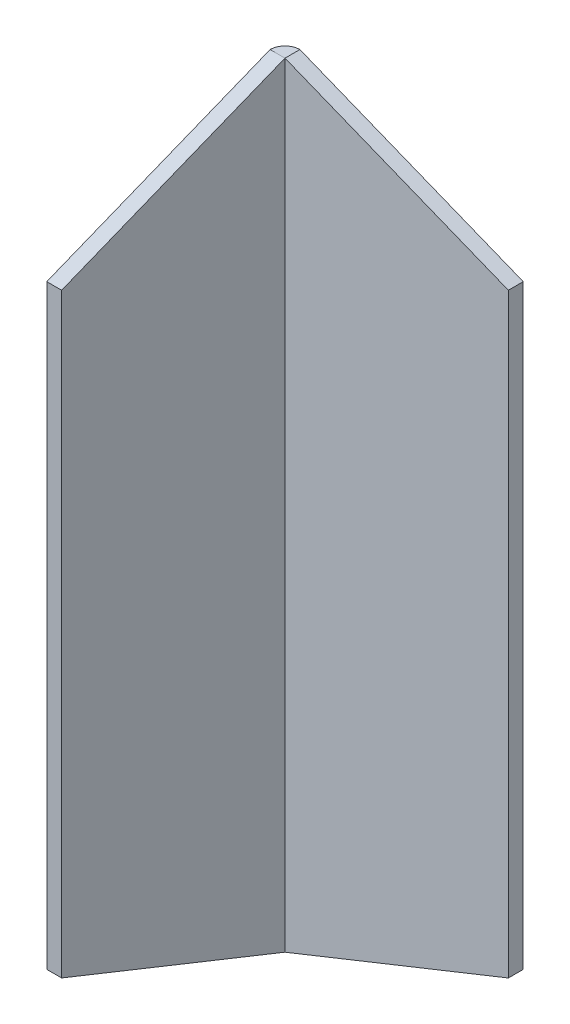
ISO-10303-21;
HEADER;
FILE_DESCRIPTION(('STEP AP214'),'2;1');
FILE_NAME('part.step','',(''),(''),'','','');
FILE_SCHEMA(('AUTOMOTIVE_DESIGN { 1 0 10303 214 1 1 1 1 }'));
ENDSEC;
DATA;
#1=APPLICATION_CONTEXT('core data for automotive mechanical design processes');
#2=APPLICATION_PROTOCOL_DEFINITION('international standard','automotive_design',2000,#1);
#3=PRODUCT_CONTEXT('',#1,'mechanical');
#4=PRODUCT('Part','Part','',(#3));
#5=PRODUCT_RELATED_PRODUCT_CATEGORY('part','',(#4));
#6=PRODUCT_DEFINITION_FORMATION('','',#4);
#7=PRODUCT_DEFINITION_CONTEXT('part definition',#1,'design');
#8=PRODUCT_DEFINITION('design','',#6,#7);
#9=PRODUCT_DEFINITION_SHAPE('','',#8);
#10=(LENGTH_UNIT() NAMED_UNIT(*) SI_UNIT(.MILLI.,.METRE.));
#11=(NAMED_UNIT(*) PLANE_ANGLE_UNIT() SI_UNIT($,.RADIAN.));
#12=(NAMED_UNIT(*) SI_UNIT($,.STERADIAN.) SOLID_ANGLE_UNIT());
#13=UNCERTAINTY_MEASURE_WITH_UNIT(LENGTH_MEASURE(1.E-05),#10,'distance_accuracy_value','');
#14=(GEOMETRIC_REPRESENTATION_CONTEXT(3) GLOBAL_UNCERTAINTY_ASSIGNED_CONTEXT((#13)) GLOBAL_UNIT_ASSIGNED_CONTEXT((#10,
#11,#12)) REPRESENTATION_CONTEXT('',''));
#15=CARTESIAN_POINT('',(0.,0.,0.));
#16=DIRECTION('',(0.,0.,1.));
#17=DIRECTION('',(1.,0.,0.));
#18=AXIS2_PLACEMENT_3D('',#15,#16,#17);
#19=CARTESIAN_POINT('',(-1.00100000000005,-6.,-14.0005865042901));
#20=DIRECTION('',(-1.,0.,0.));
#21=DIRECTION('',(0.,0.,1.));
#22=AXIS2_PLACEMENT_3D('',#19,#20,#21);
#23=PLANE('',#22);
#24=DIRECTION('',(0.,-0.371390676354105,0.928476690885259));
#25=VECTOR('',#24,1.);
#26=CARTESIAN_POINT('',(-1.001,52.,0.999413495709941));
#27=LINE('',#26,#25);
#28=CARTESIAN_POINT('',(-1.001,51.999365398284,1.001));
#29=VERTEX_POINT('',#28);
#30=CARTESIAN_POINT('',(-1.00099999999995,46.,15.9994134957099));
#31=VERTEX_POINT('',#30);
#32=EDGE_CURVE('E70',#29,#31,#27,.T.);
#33=ORIENTED_EDGE('',*,*,#32,.F.);
#34=DIRECTION('',(0.,-1.,0.));
#35=VECTOR('',#34,1.);
#36=CARTESIAN_POINT('',(-1.001,-6.,1.001));
#37=LINE('',#36,#35);
#38=CARTESIAN_POINT('',(-1.001,0.000634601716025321,1.001));
#39=VERTEX_POINT('',#38);
#40=EDGE_CURVE('E63',#29,#39,#37,.T.);
#41=ORIENTED_EDGE('',*,*,#40,.T.);
#42=DIRECTION('',(0.,-0.371390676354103,-0.928476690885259));
#43=VECTOR('',#42,1.);
#44=CARTESIAN_POINT('',(-1.00099999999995,6.,15.9994134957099));
#45=LINE('',#44,#43);
#46=CARTESIAN_POINT('',(-1.00099999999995,6.,15.9994134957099));
#47=VERTEX_POINT('',#46);
#48=EDGE_CURVE('E78',#47,#39,#45,.T.);
#49=ORIENTED_EDGE('',*,*,#48,.F.);
#50=DIRECTION('',(0.,-1.,0.));
#51=VECTOR('',#50,1.);
#52=CARTESIAN_POINT('',(-1.00099999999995,46.,15.9994134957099));
#53=LINE('',#52,#51);
#54=EDGE_CURVE('E494',#31,#47,#53,.T.);
#55=ORIENTED_EDGE('',*,*,#54,.F.);
#56=EDGE_LOOP('',(#33,#41,#49,#55));
#57=FACE_BOUND('',#56,.T.);
#58=ADVANCED_FACE('F51',(#57),#23,.T.);
#59=CARTESIAN_POINT('',(-0.000999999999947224,6.,15.9994134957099));
#60=DIRECTION('',(0.,0.928476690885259,-0.371390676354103));
#61=DIRECTION('',(0.,0.371390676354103,0.928476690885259));
#62=AXIS2_PLACEMENT_3D('',#59,#60,#61);
#63=PLANE('',#62);
#64=CARTESIAN_POINT('',(-0.001,0.000634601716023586,1.001));
#65=CARTESIAN_POINT('',(-1.001,0.000634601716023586,1.00099999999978));
#66=B_SPLINE_CURVE_WITH_KNOTS('',1,(#64,#65),.UNSPECIFIED.,.F.,.F.,(2,2),(0.,1.),.UNSPECIFIED.);
#67=CARTESIAN_POINT('',(-0.001,0.000634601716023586,1.001));
#68=VERTEX_POINT('',#67);
#69=EDGE_CURVE('E383',#68,#39,#66,.T.);
#70=ORIENTED_EDGE('',*,*,#69,.F.);
#71=DIRECTION('',(0.,-0.371390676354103,-0.928476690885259));
#72=VECTOR('',#71,1.);
#73=CARTESIAN_POINT('',(-0.000999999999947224,6.,15.9994134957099));
#74=LINE('',#73,#72);
#75=CARTESIAN_POINT('',(-0.000999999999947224,6.,15.9994134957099));
#76=VERTEX_POINT('',#75);
#77=EDGE_CURVE('E501',#76,#68,#74,.T.);
#78=ORIENTED_EDGE('',*,*,#77,.F.);
#79=DIRECTION('',(-1.,0.,0.));
#80=VECTOR('',#79,1.);
#81=CARTESIAN_POINT('',(-0.000999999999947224,6.,15.9994134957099));
#82=LINE('',#81,#80);
#83=EDGE_CURVE('E511',#76,#47,#82,.T.);
#84=ORIENTED_EDGE('',*,*,#83,.T.);
#85=ORIENTED_EDGE('',*,*,#48,.T.);
#86=EDGE_LOOP('',(#70,#78,#84,#85));
#87=FACE_BOUND('',#86,.T.);
#88=ADVANCED_FACE('F193',(#87),#63,.F.);
#89=CARTESIAN_POINT('',(-0.000999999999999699,52.,0.999413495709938));
#90=DIRECTION('',(0.,-0.928476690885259,-0.371390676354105));
#91=DIRECTION('',(0.,0.371390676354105,-0.928476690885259));
#92=AXIS2_PLACEMENT_3D('',#89,#90,#91);
#93=PLANE('',#92);
#94=CARTESIAN_POINT('',(-1.001,51.999365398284,1.001));
#95=CARTESIAN_POINT('',(-0.001,51.999365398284,1.001));
#96=B_SPLINE_CURVE_WITH_KNOTS('',1,(#94,#95),.UNSPECIFIED.,.F.,.F.,(2,2),(0.,1.),.UNSPECIFIED.);
#97=CARTESIAN_POINT('',(-0.000999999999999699,51.999365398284,1.001));
#98=VERTEX_POINT('',#97);
#99=EDGE_CURVE('E12',#29,#98,#96,.T.);
#100=ORIENTED_EDGE('',*,*,#99,.F.);
#101=ORIENTED_EDGE('',*,*,#32,.T.);
#102=DIRECTION('',(-1.,0.,0.));
#103=VECTOR('',#102,1.);
#104=CARTESIAN_POINT('',(-0.000999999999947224,46.,15.9994134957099));
#105=LINE('',#104,#103);
#106=CARTESIAN_POINT('',(-0.000999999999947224,46.,15.9994134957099));
#107=VERTEX_POINT('',#106);
#108=EDGE_CURVE('E508',#107,#31,#105,.T.);
#109=ORIENTED_EDGE('',*,*,#108,.F.);
#110=DIRECTION('',(0.,-0.371390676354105,0.928476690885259));
#111=VECTOR('',#110,1.);
#112=CARTESIAN_POINT('',(-0.000999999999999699,52.,0.999413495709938));
#113=LINE('',#112,#111);
#114=EDGE_CURVE('E506',#98,#107,#113,.T.);
#115=ORIENTED_EDGE('',*,*,#114,.F.);
#116=EDGE_LOOP('',(#100,#101,#109,#115));
#117=FACE_BOUND('',#116,.T.);
#118=ADVANCED_FACE('F53',(#117),#93,.F.);
#119=CARTESIAN_POINT('',(-0.000999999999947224,46.,15.9994134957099));
#120=DIRECTION('',(0.,0.,-1.));
#121=DIRECTION('',(0.,1.,0.));
#122=AXIS2_PLACEMENT_3D('',#119,#120,#121);
#123=PLANE('',#122);
#124=ORIENTED_EDGE('',*,*,#54,.T.);
#125=ORIENTED_EDGE('',*,*,#83,.F.);
#126=DIRECTION('',(0.,-1.,0.));
#127=VECTOR('',#126,1.);
#128=CARTESIAN_POINT('',(-0.000999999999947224,46.,15.9994134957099));
#129=LINE('',#128,#127);
#130=EDGE_CURVE('E504',#107,#76,#129,.T.);
#131=ORIENTED_EDGE('',*,*,#130,.F.);
#132=ORIENTED_EDGE('',*,*,#108,.T.);
#133=EDGE_LOOP('',(#124,#125,#131,#132));
#134=FACE_BOUND('',#133,.T.);
#135=ADVANCED_FACE('F185',(#134),#123,.F.);
#136=CARTESIAN_POINT('',(-0.00100000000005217,-6.,-14.0005865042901));
#137=DIRECTION('',(-1.,0.,0.));
#138=DIRECTION('',(0.,0.,1.));
#139=AXIS2_PLACEMENT_3D('',#136,#137,#138);
#140=PLANE('',#139);
#141=DIRECTION('',(0.,-1.,0.));
#142=VECTOR('',#141,1.);
#143=CARTESIAN_POINT('',(-0.000999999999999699,-6.,1.001));
#144=LINE('',#143,#142);
#145=EDGE_CURVE('E485',#98,#68,#144,.T.);
#146=ORIENTED_EDGE('',*,*,#145,.F.);
#147=ORIENTED_EDGE('',*,*,#114,.T.);
#148=ORIENTED_EDGE('',*,*,#130,.T.);
#149=ORIENTED_EDGE('',*,*,#77,.T.);
#150=EDGE_LOOP('',(#146,#147,#148,#149));
#151=FACE_BOUND('',#150,.T.);
#152=ADVANCED_FACE('F188',(#151),#140,.F.);
#153=CARTESIAN_POINT('',(15.,46.,1.));
#154=DIRECTION('',(-1.,0.,0.));
#155=DIRECTION('',(0.,-1.,0.));
#156=AXIS2_PLACEMENT_3D('',#153,#154,#155);
#157=PLANE('',#156);
#158=DIRECTION('',(0.,1.,0.));
#159=VECTOR('',#158,1.);
#160=CARTESIAN_POINT('',(15.,46.,0.));
#161=LINE('',#160,#159);
#162=CARTESIAN_POINT('',(15.,6.,0.));
#163=VERTEX_POINT('',#162);
#164=CARTESIAN_POINT('',(15.,46.,0.));
#165=VERTEX_POINT('',#164);
#166=EDGE_CURVE('E410',#163,#165,#161,.T.);
#167=ORIENTED_EDGE('',*,*,#166,.T.);
#168=DIRECTION('',(0.,0.,-1.));
#169=VECTOR('',#168,1.);
#170=CARTESIAN_POINT('',(15.,46.,1.));
#171=LINE('',#170,#169);
#172=CARTESIAN_POINT('',(15.,46.,1.));
#173=VERTEX_POINT('',#172);
#174=EDGE_CURVE('E400',#173,#165,#171,.T.);
#175=ORIENTED_EDGE('',*,*,#174,.F.);
#176=DIRECTION('',(0.,1.,0.));
#177=VECTOR('',#176,1.);
#178=CARTESIAN_POINT('',(15.,46.,1.));
#179=LINE('',#178,#177);
#180=CARTESIAN_POINT('',(15.,6.,1.));
#181=VERTEX_POINT('',#180);
#182=EDGE_CURVE('E153',#181,#173,#179,.T.);
#183=ORIENTED_EDGE('',*,*,#182,.F.);
#184=DIRECTION('',(0.,0.,-1.));
#185=VECTOR('',#184,1.);
#186=CARTESIAN_POINT('',(15.,6.,1.));
#187=LINE('',#186,#185);
#188=EDGE_CURVE('E157',#181,#163,#187,.T.);
#189=ORIENTED_EDGE('',*,*,#188,.T.);
#190=EDGE_LOOP('',(#167,#175,#183,#189));
#191=FACE_BOUND('',#190,.T.);
#192=ADVANCED_FACE('F191',(#191),#157,.F.);
#193=CARTESIAN_POINT('',(15.,-6.,1.));
#194=DIRECTION('',(0.,0.,-1.));
#195=DIRECTION('',(-1.,0.,0.));
#196=AXIS2_PLACEMENT_3D('',#193,#194,#195);
#197=PLANE('',#196);
#198=DIRECTION('',(-0.928476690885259,0.371390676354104,0.));
#199=VECTOR('',#198,1.);
#200=CARTESIAN_POINT('',(0.,52.,1.));
#201=LINE('',#200,#199);
#202=CARTESIAN_POINT('',(0.,52.,1.));
#203=VERTEX_POINT('',#202);
#204=EDGE_CURVE('E148',#173,#203,#201,.T.);
#205=ORIENTED_EDGE('',*,*,#204,.T.);
#206=DIRECTION('',(0.,-1.,0.));
#207=VECTOR('',#206,1.);
#208=CARTESIAN_POINT('',(0.,-6.,1.));
#209=LINE('',#208,#207);
#210=CARTESIAN_POINT('',(0.,0.,1.));
#211=VERTEX_POINT('',#210);
#212=EDGE_CURVE('E140',#203,#211,#209,.T.);
#213=ORIENTED_EDGE('',*,*,#212,.T.);
#214=DIRECTION('',(0.928476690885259,0.371390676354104,0.));
#215=VECTOR('',#214,1.);
#216=CARTESIAN_POINT('',(15.,6.,1.));
#217=LINE('',#216,#215);
#218=EDGE_CURVE('E147',#211,#181,#217,.T.);
#219=ORIENTED_EDGE('',*,*,#218,.T.);
#220=ORIENTED_EDGE('',*,*,#182,.T.);
#221=EDGE_LOOP('',(#205,#213,#219,#220));
#222=FACE_BOUND('',#221,.T.);
#223=ADVANCED_FACE('F151',(#222),#197,.F.);
#224=CARTESIAN_POINT('',(15.,6.,1.));
#225=DIRECTION('',(-0.371390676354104,0.928476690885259,0.));
#226=DIRECTION('',(-0.928476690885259,-0.371390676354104,0.));
#227=AXIS2_PLACEMENT_3D('',#224,#225,#226);
#228=PLANE('',#227);
#229=DIRECTION('',(0.928476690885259,0.371390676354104,0.));
#230=VECTOR('',#229,1.);
#231=CARTESIAN_POINT('',(15.,6.,0.));
#232=LINE('',#231,#230);
#233=CARTESIAN_POINT('',(0.,0.,0.));
#234=VERTEX_POINT('',#233);
#235=EDGE_CURVE('E392',#234,#163,#232,.T.);
#236=ORIENTED_EDGE('',*,*,#235,.T.);
#237=ORIENTED_EDGE('',*,*,#188,.F.);
#238=ORIENTED_EDGE('',*,*,#218,.F.);
#239=CARTESIAN_POINT('',(0.,0.,0.));
#240=CARTESIAN_POINT('',(0.,0.,1.));
#241=B_SPLINE_CURVE_WITH_KNOTS('',1,(#239,#240),.UNSPECIFIED.,.F.,.F.,(2,2),(0.,1.),.UNSPECIFIED.);
#242=EDGE_CURVE('E386',#211,#234,#241,.F.);
#243=ORIENTED_EDGE('',*,*,#242,.T.);
#244=EDGE_LOOP('',(#236,#237,#238,#243));
#245=FACE_BOUND('',#244,.T.);
#246=ADVANCED_FACE('F230',(#245),#228,.F.);
#247=CARTESIAN_POINT('',(15.,-6.,0.));
#248=DIRECTION('',(0.,0.,-1.));
#249=DIRECTION('',(-1.,0.,0.));
#250=AXIS2_PLACEMENT_3D('',#247,#248,#249);
#251=PLANE('',#250);
#252=DIRECTION('',(0.,-1.,0.));
#253=VECTOR('',#252,1.);
#254=CARTESIAN_POINT('',(0.,-6.,0.));
#255=LINE('',#254,#253);
#256=CARTESIAN_POINT('',(0.,52.,0.));
#257=VERTEX_POINT('',#256);
#258=EDGE_CURVE('E165',#257,#234,#255,.T.);
#259=ORIENTED_EDGE('',*,*,#258,.F.);
#260=DIRECTION('',(-0.928476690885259,0.371390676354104,0.));
#261=VECTOR('',#260,1.);
#262=CARTESIAN_POINT('',(0.,52.,0.));
#263=LINE('',#262,#261);
#264=EDGE_CURVE('E163',#165,#257,#263,.T.);
#265=ORIENTED_EDGE('',*,*,#264,.F.);
#266=ORIENTED_EDGE('',*,*,#166,.F.);
#267=ORIENTED_EDGE('',*,*,#235,.F.);
#268=EDGE_LOOP('',(#259,#265,#266,#267));
#269=FACE_BOUND('',#268,.T.);
#270=ADVANCED_FACE('F183',(#269),#251,.T.);
#271=CARTESIAN_POINT('',(0.,52.,1.));
#272=DIRECTION('',(-0.371390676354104,-0.928476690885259,0.));
#273=DIRECTION('',(0.928476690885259,-0.371390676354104,0.));
#274=AXIS2_PLACEMENT_3D('',#271,#272,#273);
#275=PLANE('',#274);
#276=ORIENTED_EDGE('',*,*,#264,.T.);
#277=CARTESIAN_POINT('',(0.,52.,1.));
#278=CARTESIAN_POINT('',(0.,52.,0.));
#279=B_SPLINE_CURVE_WITH_KNOTS('',1,(#277,#278),.UNSPECIFIED.,.F.,.F.,(2,2),(0.,1.),.UNSPECIFIED.);
#280=EDGE_CURVE('E126',#203,#257,#279,.T.);
#281=ORIENTED_EDGE('',*,*,#280,.F.);
#282=ORIENTED_EDGE('',*,*,#204,.F.);
#283=ORIENTED_EDGE('',*,*,#174,.T.);
#284=EDGE_LOOP('',(#276,#281,#282,#283));
#285=FACE_BOUND('',#284,.T.);
#286=ADVANCED_FACE('F161',(#285),#275,.F.);
#287=CARTESIAN_POINT('',(0.,52.,0.));
#288=CARTESIAN_POINT('',(-0.131054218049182,51.9999490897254,0.));
#289=CARTESIAN_POINT('',(-0.262009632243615,51.9998977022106,0.0260533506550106));
#290=CARTESIAN_POINT('',(-0.504122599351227,51.999793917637,0.126339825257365));
#291=CARTESIAN_POINT('',(-0.615161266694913,51.9997415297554,0.200533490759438));
#292=CARTESIAN_POINT('',(-0.8004665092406,51.9996357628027,0.385838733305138));
#293=CARTESIAN_POINT('',(-0.874660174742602,51.9995823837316,0.496877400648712));
#294=CARTESIAN_POINT('',(-0.974946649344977,51.9994746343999,0.738990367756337));
#295=CARTESIAN_POINT('',(-1.001,51.9994202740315,0.869945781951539));
#296=CARTESIAN_POINT('',(-1.001,51.999365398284,1.001));
#297=CARTESIAN_POINT('',(0.,52.,1.));
#298=CARTESIAN_POINT('',(-0.000130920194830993,51.9999490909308,1.));
#299=CARTESIAN_POINT('',(-0.000261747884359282,51.9998977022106,1.00002602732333));
#300=CARTESIAN_POINT('',(-0.000503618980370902,51.999793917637,1.00012621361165));
#301=CARTESIAN_POINT('',(-0.000614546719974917,51.9997415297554,1.0002003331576));
#302=CARTESIAN_POINT('',(-0.000799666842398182,51.9996357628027,1.00038545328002));
#303=CARTESIAN_POINT('',(-0.000873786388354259,51.9995823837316,1.00049638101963));
#304=CARTESIAN_POINT('',(-0.000973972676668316,51.9994746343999,1.00073825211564));
#305=CARTESIAN_POINT('',(-0.001,51.9994202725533,1.00086908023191));
#306=CARTESIAN_POINT('',(-0.001,51.999365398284,1.001));
#307=B_SPLINE_SURFACE_WITH_KNOTS('',1,3,((#287,#288,#289,#290,#291,#292,#293,#294,#295,#296),
(#297,#298,#299,#300,#301,#302,#303,#304,#305,#306)),.UNSPECIFIED.,.F.,.F.,.F.,(2,2),(4,2,2,2,
4),(0.,1.),(0.,0.25,0.5,0.75,1.),.UNSPECIFIED.);
#308=CARTESIAN_POINT('',(0.,52.,0.));
#309=CARTESIAN_POINT('',(-0.131054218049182,51.9999490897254,0.));
#310=CARTESIAN_POINT('',(-0.262009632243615,51.9998977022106,0.0260533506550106));
#311=CARTESIAN_POINT('',(-0.504122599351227,51.999793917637,0.126339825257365));
#312=CARTESIAN_POINT('',(-0.615161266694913,51.9997415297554,0.200533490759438));
#313=CARTESIAN_POINT('',(-0.8004665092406,51.9996357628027,0.385838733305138));
#314=CARTESIAN_POINT('',(-0.874660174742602,51.9995823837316,0.496877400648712));
#315=CARTESIAN_POINT('',(-0.974946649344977,51.9994746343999,0.738990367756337));
#316=CARTESIAN_POINT('',(-1.001,51.9994202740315,0.869945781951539));
#317=CARTESIAN_POINT('',(-1.001,51.999365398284,1.001));
#318=B_SPLINE_CURVE_WITH_KNOTS('',3,(#308,#309,#310,#311,#312,#313,#314,#315,#316,#317),
.UNSPECIFIED.,.F.,.F.,(4,2,2,2,4),(0.,0.25,0.5,0.75,1.),.UNSPECIFIED.);
#319=EDGE_CURVE('E354',#257,#29,#318,.T.);
#320=CARTESIAN_POINT('',(-0.001,51.999365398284,1.001));
#321=CARTESIAN_POINT('',(-0.001,51.9994202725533,1.00086908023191));
#322=CARTESIAN_POINT('',(-0.000973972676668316,51.9994746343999,1.00073825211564));
#323=CARTESIAN_POINT('',(-0.000873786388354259,51.9995823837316,1.00049638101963));
#324=CARTESIAN_POINT('',(-0.000799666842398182,51.9996357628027,1.00038545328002));
#325=CARTESIAN_POINT('',(-0.000614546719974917,51.9997415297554,1.0002003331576));
#326=CARTESIAN_POINT('',(-0.000503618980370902,51.999793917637,1.00012621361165));
#327=CARTESIAN_POINT('',(-0.000261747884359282,51.9998977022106,1.00002602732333));
#328=CARTESIAN_POINT('',(-0.000130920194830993,51.9999490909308,1.));
#329=CARTESIAN_POINT('',(0.,52.,1.));
#330=B_SPLINE_CURVE_WITH_KNOTS('',3,(#320,#321,#322,#323,#324,#325,#326,#327,#328,#329),
.UNSPECIFIED.,.F.,.F.,(4,2,2,2,4),(0.,0.25,0.5,0.75,1.),.UNSPECIFIED.);
#331=EDGE_CURVE('E120',#203,#98,#330,.F.);
#332=ORIENTED_EDGE('',*,*,#280,.T.);
#333=ORIENTED_EDGE('',*,*,#319,.T.);
#334=ORIENTED_EDGE('',*,*,#99,.T.);
#335=ORIENTED_EDGE('',*,*,#331,.F.);
#336=EDGE_LOOP('',(#332,#333,#334,#335));
#337=FACE_BOUND('',#336,.T.);
#338=ADVANCED_FACE('F123',(#337),#307,.F.);
#339=CARTESIAN_POINT('',(-1.001,0.000634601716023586,1.00099999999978));
#340=CARTESIAN_POINT('',(-1.00099999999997,0.000583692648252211,0.869945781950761));
#341=CARTESIAN_POINT('',(-0.974946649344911,0.000532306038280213,0.738990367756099));
#342=CARTESIAN_POINT('',(-0.874660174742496,0.000428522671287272,0.496877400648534));
#343=CARTESIAN_POINT('',(-0.800466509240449,0.000376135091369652,0.385838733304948));
#344=CARTESIAN_POINT('',(-0.615161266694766,0.000270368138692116,0.200533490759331));
#345=CARTESIAN_POINT('',(-0.504122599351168,0.000216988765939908,0.126339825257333));
#346=CARTESIAN_POINT('',(-0.262009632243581,0.000109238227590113,0.0260533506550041));
#347=CARTESIAN_POINT('',(-0.131054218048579,5.48769543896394E-05,0.));
#348=CARTESIAN_POINT('',(0.,0.,0.));
#349=CARTESIAN_POINT('',(-0.001,0.000634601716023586,1.001));
#350=CARTESIAN_POINT('',(-0.000999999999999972,0.000583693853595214,1.00086907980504));
#351=CARTESIAN_POINT('',(-0.000973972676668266,0.000532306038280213,1.00073825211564));
#352=CARTESIAN_POINT('',(-0.000873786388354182,0.000428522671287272,1.00049638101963));
#353=CARTESIAN_POINT('',(-0.000799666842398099,0.000376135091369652,1.00038545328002));
#354=CARTESIAN_POINT('',(-0.000614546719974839,0.000270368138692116,1.0002003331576));
#355=CARTESIAN_POINT('',(-0.000503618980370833,0.000216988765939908,1.00012621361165));
#356=CARTESIAN_POINT('',(-0.000261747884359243,0.000109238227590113,1.00002602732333));
#357=CARTESIAN_POINT('',(-0.000130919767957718,5.48754761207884E-05,1.));
#358=CARTESIAN_POINT('',(0.,0.,1.));
#359=B_SPLINE_SURFACE_WITH_KNOTS('',1,3,((#339,#340,#341,#342,#343,#344,#345,#346,#347,#348),
(#349,#350,#351,#352,#353,#354,#355,#356,#357,#358)),.UNSPECIFIED.,.F.,.F.,.F.,(2,2),(4,2,2,2,
4),(0.,1.),(0.,0.25,0.5,0.75,1.),.UNSPECIFIED.);
#360=CARTESIAN_POINT('',(-1.001,0.000634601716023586,1.00099999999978));
#361=CARTESIAN_POINT('',(-1.00099999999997,0.000583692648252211,0.869945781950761));
#362=CARTESIAN_POINT('',(-0.974946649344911,0.000532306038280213,0.738990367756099));
#363=CARTESIAN_POINT('',(-0.874660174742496,0.000428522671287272,0.496877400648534));
#364=CARTESIAN_POINT('',(-0.800466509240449,0.000376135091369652,0.385838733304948));
#365=CARTESIAN_POINT('',(-0.615161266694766,0.000270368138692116,0.200533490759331));
#366=CARTESIAN_POINT('',(-0.504122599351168,0.000216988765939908,0.126339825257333));
#367=CARTESIAN_POINT('',(-0.262009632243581,0.000109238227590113,0.0260533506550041));
#368=CARTESIAN_POINT('',(-0.131054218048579,5.48769543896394E-05,0.));
#369=CARTESIAN_POINT('',(0.,0.,0.));
#370=B_SPLINE_CURVE_WITH_KNOTS('',3,(#360,#361,#362,#363,#364,#365,#366,#367,#368,#369),
.UNSPECIFIED.,.F.,.F.,(4,2,2,2,4),(0.,0.25,0.5,0.75,1.),.UNSPECIFIED.);
#371=EDGE_CURVE('E135',#39,#234,#370,.T.);
#372=CARTESIAN_POINT('',(0.,0.,1.));
#373=CARTESIAN_POINT('',(-0.000130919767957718,5.48754761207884E-05,1.));
#374=CARTESIAN_POINT('',(-0.000261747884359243,0.000109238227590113,1.00002602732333));
#375=CARTESIAN_POINT('',(-0.000503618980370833,0.000216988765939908,1.00012621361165));
#376=CARTESIAN_POINT('',(-0.000614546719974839,0.000270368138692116,1.0002003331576));
#377=CARTESIAN_POINT('',(-0.000799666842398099,0.000376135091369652,1.00038545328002));
#378=CARTESIAN_POINT('',(-0.000873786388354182,0.000428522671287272,1.00049638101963));
#379=CARTESIAN_POINT('',(-0.000973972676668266,0.000532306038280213,1.00073825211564));
#380=CARTESIAN_POINT('',(-0.000999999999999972,0.000583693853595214,1.00086907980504));
#381=CARTESIAN_POINT('',(-0.001,0.000634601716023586,1.001));
#382=B_SPLINE_CURVE_WITH_KNOTS('',3,(#372,#373,#374,#375,#376,#377,#378,#379,#380,#381),
.UNSPECIFIED.,.F.,.F.,(4,2,2,2,4),(0.,0.25,0.5,0.75,1.),.UNSPECIFIED.);
#383=EDGE_CURVE('E134',#68,#211,#382,.F.);
#384=ORIENTED_EDGE('',*,*,#69,.T.);
#385=ORIENTED_EDGE('',*,*,#371,.T.);
#386=ORIENTED_EDGE('',*,*,#242,.F.);
#387=ORIENTED_EDGE('',*,*,#383,.F.);
#388=EDGE_LOOP('',(#384,#385,#386,#387));
#389=FACE_BOUND('',#388,.T.);
#390=ADVANCED_FACE('F253',(#389),#359,.F.);
#391=CARTESIAN_POINT('',(0.,78.0096145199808,1.001));
#392=DIRECTION('',(0.,-1.,0.));
#393=DIRECTION('',(0.,0.,-1.));
#394=AXIS2_PLACEMENT_3D('',#391,#392,#393);
#395=CYLINDRICAL_SURFACE('',#394,0.001);
#396=ORIENTED_EDGE('',*,*,#383,.T.);
#397=ORIENTED_EDGE('',*,*,#212,.F.);
#398=ORIENTED_EDGE('',*,*,#331,.T.);
#399=ORIENTED_EDGE('',*,*,#145,.T.);
#400=EDGE_LOOP('',(#396,#397,#398,#399));
#401=FACE_BOUND('',#400,.T.);
#402=ADVANCED_FACE('F142',(#401),#395,.F.);
#403=CARTESIAN_POINT('',(0.,78.0096145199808,1.001));
#404=DIRECTION('',(0.,-1.,0.));
#405=DIRECTION('',(0.,0.,-1.));
#406=AXIS2_PLACEMENT_3D('',#403,#404,#405);
#407=CYLINDRICAL_SURFACE('',#406,1.001);
#408=ORIENTED_EDGE('',*,*,#371,.F.);
#409=ORIENTED_EDGE('',*,*,#40,.F.);
#410=ORIENTED_EDGE('',*,*,#319,.F.);
#411=ORIENTED_EDGE('',*,*,#258,.T.);
#412=EDGE_LOOP('',(#408,#409,#410,#411));
#413=FACE_BOUND('',#412,.T.);
#414=ADVANCED_FACE('F267',(#413),#407,.T.);
#415=CLOSED_SHELL('',(#58,#88,#118,#135,#152,#192,#223,#246,#270,#286,#338,#390,#402,#414));
#416=MANIFOLD_SOLID_BREP('B2',#415);
#417=ADVANCED_BREP_SHAPE_REPRESENTATION('',(#18,#416),#14);
#418=SHAPE_DEFINITION_REPRESENTATION(#9,#417);
ENDSEC;
END-ISO-10303-21;
